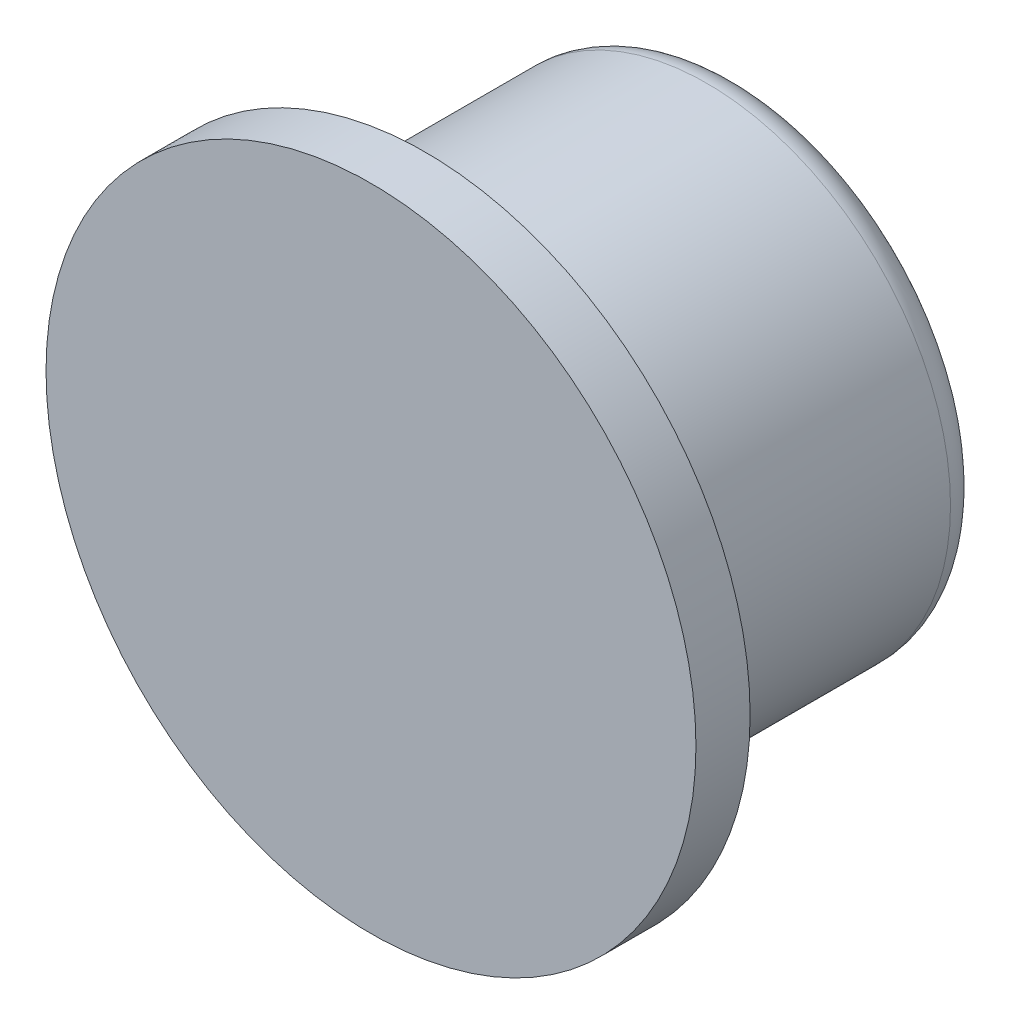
from build123d import *


with BuildPart() as part:
    # Sketch1 → Revolve1 (revolve)
    with BuildSketch(Plane(origin=(0, 0, 0), x_dir=(0, 0, -1), z_dir=(1, 0, 0)), mode=Mode.PRIVATE) as revolve1_sk:
        with BuildLine():
            Line((0, 0), (0, 30))
            Line((0, 30), (5, 30))
            Line((5, 30), (5, 22.5))
            Line((5, 22.5), (31, 22.5))
            ThreePointArc((31, 22.5), (33.121320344, 21.621320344), (34, 19.5))
            Line((34, 19.5), (34, 4.5))
            Line((34, 4.5), (33.5, 4))
            Line((33.5, 4), (25, 4))
            Line((25, 4), (22.690598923, 0))
            Line((22.690598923, 0), (0, 0))
        make_face()
    revolve(revolve1_sk.sketch.rotate(Axis((0, 0, -22.690598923), (0, 0, 1)), 90), axis=Axis((0, 0, -22.690598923), (0, 0, 1)))


solid = part.part
